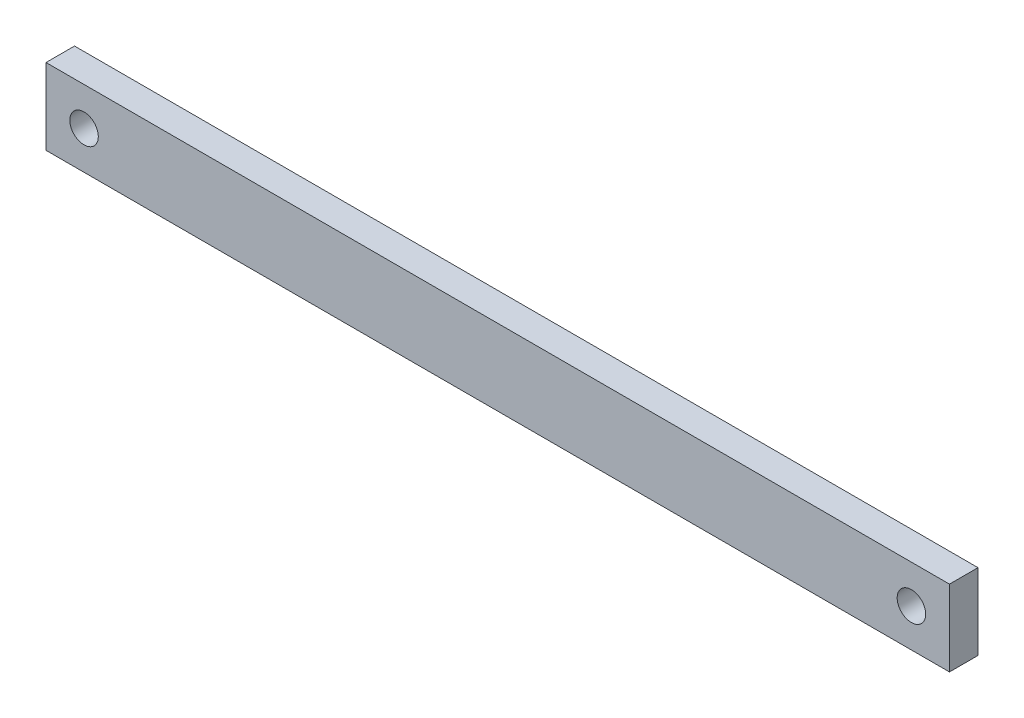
ISO-10303-21;
HEADER;
FILE_DESCRIPTION(('STEP AP214'),'2;1');
FILE_NAME('part.step','',(''),(''),'','','');
FILE_SCHEMA(('AUTOMOTIVE_DESIGN { 1 0 10303 214 1 1 1 1 }'));
ENDSEC;
DATA;
#1=APPLICATION_CONTEXT('core data for automotive mechanical design processes');
#2=APPLICATION_PROTOCOL_DEFINITION('international standard','automotive_design',2000,#1);
#3=PRODUCT_CONTEXT('',#1,'mechanical');
#4=PRODUCT('Part','Part','',(#3));
#5=PRODUCT_RELATED_PRODUCT_CATEGORY('part','',(#4));
#6=PRODUCT_DEFINITION_FORMATION('','',#4);
#7=PRODUCT_DEFINITION_CONTEXT('part definition',#1,'design');
#8=PRODUCT_DEFINITION('design','',#6,#7);
#9=PRODUCT_DEFINITION_SHAPE('','',#8);
#10=(LENGTH_UNIT() NAMED_UNIT(*) SI_UNIT(.MILLI.,.METRE.));
#11=(NAMED_UNIT(*) PLANE_ANGLE_UNIT() SI_UNIT($,.RADIAN.));
#12=(NAMED_UNIT(*) SI_UNIT($,.STERADIAN.) SOLID_ANGLE_UNIT());
#13=UNCERTAINTY_MEASURE_WITH_UNIT(LENGTH_MEASURE(1.E-05),#10,'distance_accuracy_value','');
#14=(GEOMETRIC_REPRESENTATION_CONTEXT(3) GLOBAL_UNCERTAINTY_ASSIGNED_CONTEXT((#13)) GLOBAL_UNIT_ASSIGNED_CONTEXT((#10,
#11,#12)) REPRESENTATION_CONTEXT('',''));
#15=CARTESIAN_POINT('',(0.,0.,0.));
#16=DIRECTION('',(0.,0.,1.));
#17=DIRECTION('',(1.,0.,0.));
#18=AXIS2_PLACEMENT_3D('',#15,#16,#17);
#19=CARTESIAN_POINT('',(-4.,-4.,3.));
#20=DIRECTION('',(0.,0.,1.));
#21=DIRECTION('',(1.,0.,0.));
#22=AXIS2_PLACEMENT_3D('',#19,#20,#21);
#23=PLANE('',#22);
#24=CARTESIAN_POINT('',(0.,0.,3.));
#25=DIRECTION('',(0.,0.,1.));
#26=DIRECTION('',(1.,0.,0.));
#27=AXIS2_PLACEMENT_3D('',#24,#25,#26);
#28=CIRCLE('',#27,1.5);
#29=CARTESIAN_POINT('',(1.5,0.,3.));
#30=VERTEX_POINT('',#29);
#31=EDGE_CURVE('E85',#30,#30,#28,.T.);
#32=ORIENTED_EDGE('',*,*,#31,.F.);
#33=EDGE_LOOP('',(#32));
#34=FACE_BOUND('',#33,.T.);
#35=DIRECTION('',(0.,-1.,0.));
#36=VECTOR('',#35,1.);
#37=CARTESIAN_POINT('',(-4.,3.99999999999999,3.));
#38=LINE('',#37,#36);
#39=CARTESIAN_POINT('',(-4.,3.99999999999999,3.));
#40=VERTEX_POINT('',#39);
#41=CARTESIAN_POINT('',(-4.,-4.,3.));
#42=VERTEX_POINT('',#41);
#43=EDGE_CURVE('E95',#40,#42,#38,.T.);
#44=ORIENTED_EDGE('',*,*,#43,.T.);
#45=DIRECTION('',(1.,0.,0.));
#46=VECTOR('',#45,1.);
#47=CARTESIAN_POINT('',(-4.,-4.,3.));
#48=LINE('',#47,#46);
#49=CARTESIAN_POINT('',(91.,-4.,3.));
#50=VERTEX_POINT('',#49);
#51=EDGE_CURVE('E80',#42,#50,#48,.T.);
#52=ORIENTED_EDGE('',*,*,#51,.T.);
#53=DIRECTION('',(0.,1.,0.));
#54=VECTOR('',#53,1.);
#55=CARTESIAN_POINT('',(91.,3.99999999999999,3.));
#56=LINE('',#55,#54);
#57=CARTESIAN_POINT('',(91.,3.99999999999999,3.));
#58=VERTEX_POINT('',#57);
#59=EDGE_CURVE('E46',#50,#58,#56,.T.);
#60=ORIENTED_EDGE('',*,*,#59,.T.);
#61=DIRECTION('',(-1.,0.,0.));
#62=VECTOR('',#61,1.);
#63=CARTESIAN_POINT('',(-4.,3.99999999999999,3.));
#64=LINE('',#63,#62);
#65=EDGE_CURVE('E41',#58,#40,#64,.T.);
#66=ORIENTED_EDGE('',*,*,#65,.T.);
#67=EDGE_LOOP('',(#44,#52,#60,#66));
#68=FACE_BOUND('',#67,.T.);
#69=CARTESIAN_POINT('',(87.,0.,3.));
#70=DIRECTION('',(0.,0.,1.));
#71=DIRECTION('',(1.,0.,0.));
#72=AXIS2_PLACEMENT_3D('',#69,#70,#71);
#73=CIRCLE('',#72,1.5);
#74=CARTESIAN_POINT('',(88.5,0.,3.));
#75=VERTEX_POINT('',#74);
#76=EDGE_CURVE('E113',#75,#75,#73,.T.);
#77=ORIENTED_EDGE('',*,*,#76,.F.);
#78=EDGE_LOOP('',(#77));
#79=FACE_BOUND('',#78,.T.);
#80=ADVANCED_FACE('F26',(#34,#68,#79),#23,.T.);
#81=CARTESIAN_POINT('',(-4.,-4.,0.));
#82=DIRECTION('',(0.,0.,1.));
#83=DIRECTION('',(1.,0.,0.));
#84=AXIS2_PLACEMENT_3D('',#81,#82,#83);
#85=PLANE('',#84);
#86=CARTESIAN_POINT('',(0.,0.,0.));
#87=DIRECTION('',(0.,0.,1.));
#88=DIRECTION('',(1.,0.,0.));
#89=AXIS2_PLACEMENT_3D('',#86,#87,#88);
#90=CIRCLE('',#89,1.5);
#91=CARTESIAN_POINT('',(1.5,0.,0.));
#92=VERTEX_POINT('',#91);
#93=EDGE_CURVE('E88',#92,#92,#90,.T.);
#94=ORIENTED_EDGE('',*,*,#93,.T.);
#95=EDGE_LOOP('',(#94));
#96=FACE_BOUND('',#95,.T.);
#97=DIRECTION('',(0.,-1.,0.));
#98=VECTOR('',#97,1.);
#99=CARTESIAN_POINT('',(-4.,3.99999999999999,0.));
#100=LINE('',#99,#98);
#101=CARTESIAN_POINT('',(-4.,3.99999999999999,0.));
#102=VERTEX_POINT('',#101);
#103=CARTESIAN_POINT('',(-4.,-4.,0.));
#104=VERTEX_POINT('',#103);
#105=EDGE_CURVE('E72',#102,#104,#100,.T.);
#106=ORIENTED_EDGE('',*,*,#105,.F.);
#107=DIRECTION('',(-1.,0.,0.));
#108=VECTOR('',#107,1.);
#109=CARTESIAN_POINT('',(-4.,3.99999999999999,0.));
#110=LINE('',#109,#108);
#111=CARTESIAN_POINT('',(91.,3.99999999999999,0.));
#112=VERTEX_POINT('',#111);
#113=EDGE_CURVE('E93',#112,#102,#110,.T.);
#114=ORIENTED_EDGE('',*,*,#113,.F.);
#115=DIRECTION('',(0.,1.,0.));
#116=VECTOR('',#115,1.);
#117=CARTESIAN_POINT('',(91.,3.99999999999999,0.));
#118=LINE('',#117,#116);
#119=CARTESIAN_POINT('',(91.,-4.,0.));
#120=VERTEX_POINT('',#119);
#121=EDGE_CURVE('E73',#120,#112,#118,.T.);
#122=ORIENTED_EDGE('',*,*,#121,.F.);
#123=DIRECTION('',(1.,0.,0.));
#124=VECTOR('',#123,1.);
#125=CARTESIAN_POINT('',(-4.,-4.,0.));
#126=LINE('',#125,#124);
#127=EDGE_CURVE('E67',#104,#120,#126,.T.);
#128=ORIENTED_EDGE('',*,*,#127,.F.);
#129=EDGE_LOOP('',(#106,#114,#122,#128));
#130=FACE_BOUND('',#129,.T.);
#131=CARTESIAN_POINT('',(87.,0.,0.));
#132=DIRECTION('',(0.,0.,1.));
#133=DIRECTION('',(1.,0.,0.));
#134=AXIS2_PLACEMENT_3D('',#131,#132,#133);
#135=CIRCLE('',#134,1.5);
#136=CARTESIAN_POINT('',(88.5,0.,0.));
#137=VERTEX_POINT('',#136);
#138=EDGE_CURVE('E115',#137,#137,#135,.T.);
#139=ORIENTED_EDGE('',*,*,#138,.T.);
#140=EDGE_LOOP('',(#139));
#141=FACE_BOUND('',#140,.T.);
#142=ADVANCED_FACE('F68',(#96,#130,#141),#85,.F.);
#143=CARTESIAN_POINT('',(-4.,3.99999999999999,3.));
#144=DIRECTION('',(1.,0.,0.));
#145=DIRECTION('',(0.,1.,0.));
#146=AXIS2_PLACEMENT_3D('',#143,#144,#145);
#147=PLANE('',#146);
#148=ORIENTED_EDGE('',*,*,#105,.T.);
#149=DIRECTION('',(0.,0.,-1.));
#150=VECTOR('',#149,1.);
#151=CARTESIAN_POINT('',(-4.,-4.,3.));
#152=LINE('',#151,#150);
#153=EDGE_CURVE('E11',#42,#104,#152,.T.);
#154=ORIENTED_EDGE('',*,*,#153,.F.);
#155=ORIENTED_EDGE('',*,*,#43,.F.);
#156=DIRECTION('',(0.,0.,-1.));
#157=VECTOR('',#156,1.);
#158=CARTESIAN_POINT('',(-4.,3.99999999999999,3.));
#159=LINE('',#158,#157);
#160=EDGE_CURVE('E84',#40,#102,#159,.T.);
#161=ORIENTED_EDGE('',*,*,#160,.T.);
#162=EDGE_LOOP('',(#148,#154,#155,#161));
#163=FACE_BOUND('',#162,.T.);
#164=ADVANCED_FACE('F28',(#163),#147,.F.);
#165=CARTESIAN_POINT('',(-4.,-4.,3.));
#166=DIRECTION('',(0.,1.,0.));
#167=DIRECTION('',(0.,0.,1.));
#168=AXIS2_PLACEMENT_3D('',#165,#166,#167);
#169=PLANE('',#168);
#170=ORIENTED_EDGE('',*,*,#127,.T.);
#171=DIRECTION('',(0.,0.,-1.));
#172=VECTOR('',#171,1.);
#173=CARTESIAN_POINT('',(91.,-4.,3.));
#174=LINE('',#173,#172);
#175=EDGE_CURVE('E34',#50,#120,#174,.T.);
#176=ORIENTED_EDGE('',*,*,#175,.F.);
#177=ORIENTED_EDGE('',*,*,#51,.F.);
#178=ORIENTED_EDGE('',*,*,#153,.T.);
#179=EDGE_LOOP('',(#170,#176,#177,#178));
#180=FACE_BOUND('',#179,.T.);
#181=ADVANCED_FACE('F79',(#180),#169,.F.);
#182=CARTESIAN_POINT('',(91.,3.99999999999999,3.));
#183=DIRECTION('',(-1.,0.,0.));
#184=DIRECTION('',(0.,0.,1.));
#185=AXIS2_PLACEMENT_3D('',#182,#183,#184);
#186=PLANE('',#185);
#187=ORIENTED_EDGE('',*,*,#121,.T.);
#188=DIRECTION('',(0.,0.,-1.));
#189=VECTOR('',#188,1.);
#190=CARTESIAN_POINT('',(91.,3.99999999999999,3.));
#191=LINE('',#190,#189);
#192=EDGE_CURVE('E101',#58,#112,#191,.T.);
#193=ORIENTED_EDGE('',*,*,#192,.F.);
#194=ORIENTED_EDGE('',*,*,#59,.F.);
#195=ORIENTED_EDGE('',*,*,#175,.T.);
#196=EDGE_LOOP('',(#187,#193,#194,#195));
#197=FACE_BOUND('',#196,.T.);
#198=ADVANCED_FACE('F104',(#197),#186,.F.);
#199=CARTESIAN_POINT('',(-4.,3.99999999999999,3.));
#200=DIRECTION('',(0.,-1.,0.));
#201=DIRECTION('',(0.,0.,-1.));
#202=AXIS2_PLACEMENT_3D('',#199,#200,#201);
#203=PLANE('',#202);
#204=ORIENTED_EDGE('',*,*,#113,.T.);
#205=ORIENTED_EDGE('',*,*,#160,.F.);
#206=ORIENTED_EDGE('',*,*,#65,.F.);
#207=ORIENTED_EDGE('',*,*,#192,.T.);
#208=EDGE_LOOP('',(#204,#205,#206,#207));
#209=FACE_BOUND('',#208,.T.);
#210=ADVANCED_FACE('F106',(#209),#203,.F.);
#211=CARTESIAN_POINT('',(0.,0.,3.));
#212=DIRECTION('',(0.,0.,-1.));
#213=DIRECTION('',(-1.,0.,0.));
#214=AXIS2_PLACEMENT_3D('',#211,#212,#213);
#215=CYLINDRICAL_SURFACE('',#214,1.5);
#216=ORIENTED_EDGE('',*,*,#31,.T.);
#217=EDGE_LOOP('',(#216));
#218=FACE_BOUND('',#217,.T.);
#219=ORIENTED_EDGE('',*,*,#93,.F.);
#220=EDGE_LOOP('',(#219));
#221=FACE_BOUND('',#220,.T.);
#222=ADVANCED_FACE('F124',(#218,#221),#215,.F.);
#223=CARTESIAN_POINT('',(87.,0.,3.));
#224=DIRECTION('',(0.,0.,-1.));
#225=DIRECTION('',(-1.,0.,0.));
#226=AXIS2_PLACEMENT_3D('',#223,#224,#225);
#227=CYLINDRICAL_SURFACE('',#226,1.5);
#228=ORIENTED_EDGE('',*,*,#76,.T.);
#229=EDGE_LOOP('',(#228));
#230=FACE_BOUND('',#229,.T.);
#231=ORIENTED_EDGE('',*,*,#138,.F.);
#232=EDGE_LOOP('',(#231));
#233=FACE_BOUND('',#232,.T.);
#234=ADVANCED_FACE('F122',(#230,#233),#227,.F.);
#235=CLOSED_SHELL('',(#80,#142,#164,#181,#198,#210,#222,#234));
#236=MANIFOLD_SOLID_BREP('B2',#235);
#237=ADVANCED_BREP_SHAPE_REPRESENTATION('',(#18,#236),#14);
#238=SHAPE_DEFINITION_REPRESENTATION(#9,#237);
ENDSEC;
END-ISO-10303-21;
